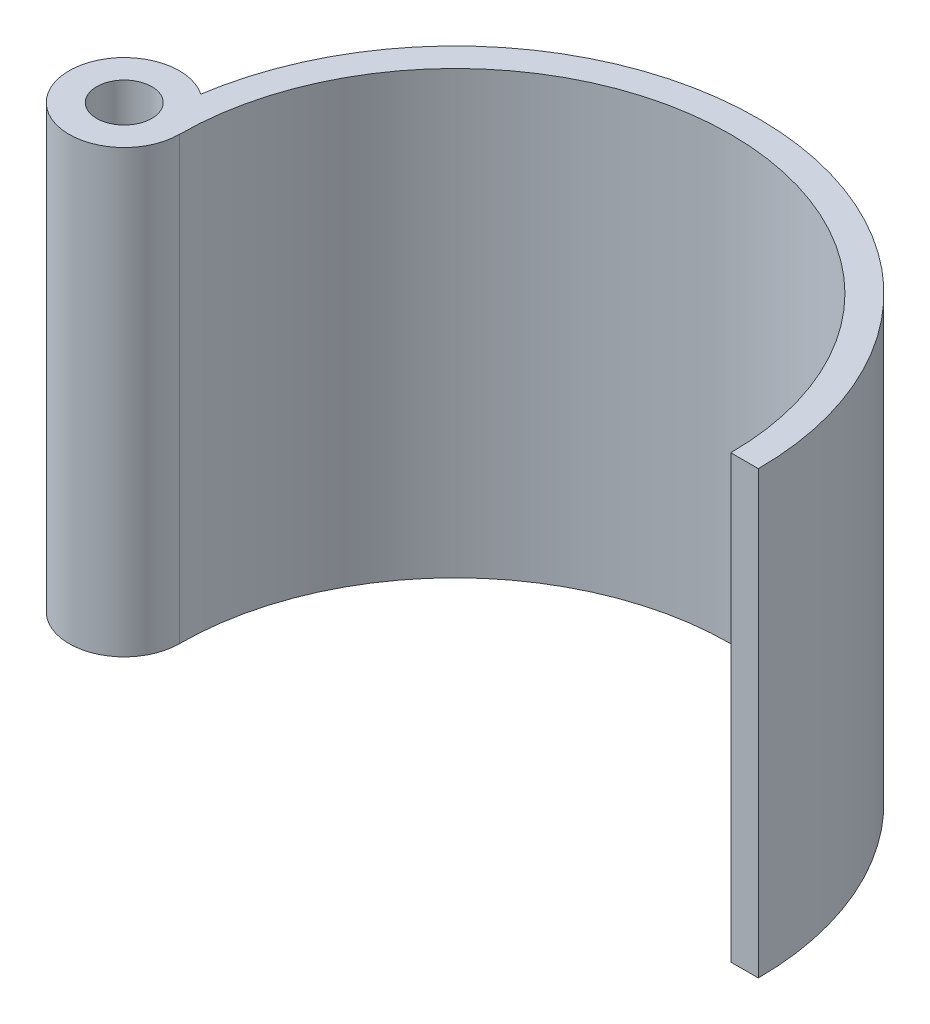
from build123d import *

# Parameters (mm, degrees)
SKETCH1_R           = 5
BOSS_EXTRUDE2_DEPTH = 80


with BuildPart() as part:
    # Sketch1 → Boss-Extrude2 (new body)
    with BuildSketch(Plane(origin=(0, 0, 0), x_dir=(1, 0, 0), z_dir=(0, 1, 0))):
        with BuildLine():
            Line((115, 0), (110, 0))
            ThreePointArc((110, 0), (60, 50), (10, 0))
            ThreePointArc((10, 0), (-8.838834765, -4.677071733), (5.625, 8.267972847))
            ThreePointArc((5.625, 8.267972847), (64.145780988, 54.843527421), (115, 0))
        make_face()
        with Locations(Location((0, 0, 0), (0, 0, 270))):
            Circle(SKETCH1_R, mode=Mode.SUBTRACT)
    extrude(amount=BOSS_EXTRUDE2_DEPTH)


solid = part.part
